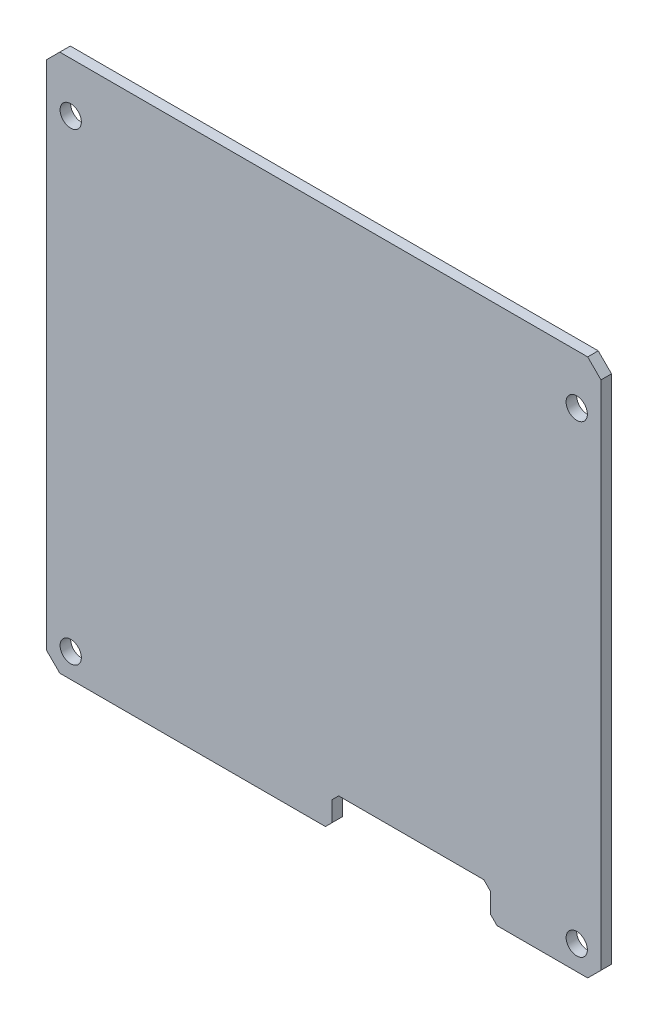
ISO-10303-21;
HEADER;
FILE_DESCRIPTION(('STEP AP214'),'2;1');
FILE_NAME('part.step','',(''),(''),'','','');
FILE_SCHEMA(('AUTOMOTIVE_DESIGN { 1 0 10303 214 1 1 1 1 }'));
ENDSEC;
DATA;
#1=APPLICATION_CONTEXT('core data for automotive mechanical design processes');
#2=APPLICATION_PROTOCOL_DEFINITION('international standard','automotive_design',2000,#1);
#3=PRODUCT_CONTEXT('',#1,'mechanical');
#4=PRODUCT('Part','Part','',(#3));
#5=PRODUCT_RELATED_PRODUCT_CATEGORY('part','',(#4));
#6=PRODUCT_DEFINITION_FORMATION('','',#4);
#7=PRODUCT_DEFINITION_CONTEXT('part definition',#1,'design');
#8=PRODUCT_DEFINITION('design','',#6,#7);
#9=PRODUCT_DEFINITION_SHAPE('','',#8);
#10=(LENGTH_UNIT() NAMED_UNIT(*) SI_UNIT(.MILLI.,.METRE.));
#11=(NAMED_UNIT(*) PLANE_ANGLE_UNIT() SI_UNIT($,.RADIAN.));
#12=(NAMED_UNIT(*) SI_UNIT($,.STERADIAN.) SOLID_ANGLE_UNIT());
#13=UNCERTAINTY_MEASURE_WITH_UNIT(LENGTH_MEASURE(1.E-05),#10,'distance_accuracy_value','');
#14=(GEOMETRIC_REPRESENTATION_CONTEXT(3) GLOBAL_UNCERTAINTY_ASSIGNED_CONTEXT((#13)) GLOBAL_UNIT_ASSIGNED_CONTEXT((#10,
#11,#12)) REPRESENTATION_CONTEXT('',''));
#15=CARTESIAN_POINT('',(0.,0.,0.));
#16=DIRECTION('',(0.,0.,1.));
#17=DIRECTION('',(1.,0.,0.));
#18=AXIS2_PLACEMENT_3D('',#15,#16,#17);
#19=CARTESIAN_POINT('',(41.75,-40.5,-0.0125000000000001));
#20=DIRECTION('',(0.,-1.,0.));
#21=DIRECTION('',(0.,0.,-1.));
#22=AXIS2_PLACEMENT_3D('',#19,#20,#21);
#23=PLANE('',#22);
#24=DIRECTION('',(-1.,0.,0.));
#25=VECTOR('',#24,1.);
#26=CARTESIAN_POINT('',(41.75,-40.5,-1.6));
#27=LINE('',#26,#25);
#28=CARTESIAN_POINT('',(0.249999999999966,-40.5,-1.6));
#29=VERTEX_POINT('',#28);
#30=CARTESIAN_POINT('',(-39.75,-40.5,-1.6));
#31=VERTEX_POINT('',#30);
#32=EDGE_CURVE('E303',#29,#31,#27,.T.);
#33=ORIENTED_EDGE('',*,*,#32,.F.);
#34=DIRECTION('',(0.,0.,1.));
#35=VECTOR('',#34,1.);
#36=CARTESIAN_POINT('',(0.249999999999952,-40.5,-0.0125000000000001));
#37=LINE('',#36,#35);
#38=CARTESIAN_POINT('',(0.249999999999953,-40.5,-0.0125000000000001));
#39=VERTEX_POINT('',#38);
#40=EDGE_CURVE('E218',#29,#39,#37,.T.);
#41=ORIENTED_EDGE('',*,*,#40,.T.);
#42=DIRECTION('',(-1.,0.,0.));
#43=VECTOR('',#42,1.);
#44=CARTESIAN_POINT('',(41.75,-40.5,-0.0125000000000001));
#45=LINE('',#44,#43);
#46=CARTESIAN_POINT('',(-39.75,-40.5,-0.0125000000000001));
#47=VERTEX_POINT('',#46);
#48=EDGE_CURVE('E178',#39,#47,#45,.T.);
#49=ORIENTED_EDGE('',*,*,#48,.T.);
#50=DIRECTION('',(0.,0.,-1.));
#51=VECTOR('',#50,1.);
#52=CARTESIAN_POINT('',(-39.75,-40.5,-0.0125000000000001));
#53=LINE('',#52,#51);
#54=EDGE_CURVE('E206',#47,#31,#53,.T.);
#55=ORIENTED_EDGE('',*,*,#54,.T.);
#56=EDGE_LOOP('',(#33,#41,#49,#55));
#57=FACE_BOUND('',#56,.T.);
#58=ADVANCED_FACE('F32',(#57),#23,.T.);
#59=CARTESIAN_POINT('',(-41.75,-40.5,-0.0125000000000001));
#60=DIRECTION('',(-1.,0.,0.));
#61=DIRECTION('',(0.,0.,1.));
#62=AXIS2_PLACEMENT_3D('',#59,#60,#61);
#63=PLANE('',#62);
#64=DIRECTION('',(0.,1.,0.));
#65=VECTOR('',#64,1.);
#66=CARTESIAN_POINT('',(-41.75,-40.5,-0.0125000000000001));
#67=LINE('',#66,#65);
#68=CARTESIAN_POINT('',(-41.75,-38.5,-0.0125000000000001));
#69=VERTEX_POINT('',#68);
#70=CARTESIAN_POINT('',(-41.75,38.5,-0.0125000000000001));
#71=VERTEX_POINT('',#70);
#72=EDGE_CURVE('E294',#69,#71,#67,.T.);
#73=ORIENTED_EDGE('',*,*,#72,.T.);
#74=DIRECTION('',(0.,0.,-1.));
#75=VECTOR('',#74,1.);
#76=CARTESIAN_POINT('',(-41.75,38.5,-0.0125000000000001));
#77=LINE('',#76,#75);
#78=CARTESIAN_POINT('',(-41.75,38.5,-1.6));
#79=VERTEX_POINT('',#78);
#80=EDGE_CURVE('E202',#71,#79,#77,.T.);
#81=ORIENTED_EDGE('',*,*,#80,.T.);
#82=DIRECTION('',(0.,1.,0.));
#83=VECTOR('',#82,1.);
#84=CARTESIAN_POINT('',(-41.75,-40.5,-1.6));
#85=LINE('',#84,#83);
#86=CARTESIAN_POINT('',(-41.75,-38.5,-1.6));
#87=VERTEX_POINT('',#86);
#88=EDGE_CURVE('E153',#87,#79,#85,.T.);
#89=ORIENTED_EDGE('',*,*,#88,.F.);
#90=DIRECTION('',(0.,0.,1.));
#91=VECTOR('',#90,1.);
#92=CARTESIAN_POINT('',(-41.75,-38.5,-0.0125000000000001));
#93=LINE('',#92,#91);
#94=EDGE_CURVE('E200',#87,#69,#93,.T.);
#95=ORIENTED_EDGE('',*,*,#94,.T.);
#96=EDGE_LOOP('',(#73,#81,#89,#95));
#97=FACE_BOUND('',#96,.T.);
#98=ADVANCED_FACE('F327',(#97),#63,.T.);
#99=CARTESIAN_POINT('',(39.75,-40.5,-0.0125000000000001));
#100=VERTEX_POINT('',#99);
#101=CARTESIAN_POINT('',(26.1,-40.5,-0.0125000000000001));
#102=VERTEX_POINT('',#101);
#103=EDGE_CURVE('E174',#100,#102,#45,.T.);
#104=ORIENTED_EDGE('',*,*,#103,.T.);
#105=DIRECTION('',(0.,0.,-1.));
#106=VECTOR('',#105,1.);
#107=CARTESIAN_POINT('',(26.1,-40.5,-1.6));
#108=LINE('',#107,#106);
#109=CARTESIAN_POINT('',(26.1,-40.5,-1.6));
#110=VERTEX_POINT('',#109);
#111=EDGE_CURVE('E232',#102,#110,#108,.T.);
#112=ORIENTED_EDGE('',*,*,#111,.T.);
#113=CARTESIAN_POINT('',(39.75,-40.5,-1.6));
#114=VERTEX_POINT('',#113);
#115=EDGE_CURVE('E181',#114,#110,#27,.T.);
#116=ORIENTED_EDGE('',*,*,#115,.F.);
#117=DIRECTION('',(0.,0.,1.));
#118=VECTOR('',#117,1.);
#119=CARTESIAN_POINT('',(39.75,-40.5,-0.0125000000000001));
#120=LINE('',#119,#118);
#121=EDGE_CURVE('E204',#114,#100,#120,.T.);
#122=ORIENTED_EDGE('',*,*,#121,.T.);
#123=EDGE_LOOP('',(#104,#112,#116,#122));
#124=FACE_BOUND('',#123,.T.);
#125=ADVANCED_FACE('F311',(#124),#23,.T.);
#126=CARTESIAN_POINT('',(41.75,-40.5,-0.0125000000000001));
#127=DIRECTION('',(1.,0.,0.));
#128=DIRECTION('',(0.,0.,-1.));
#129=AXIS2_PLACEMENT_3D('',#126,#127,#128);
#130=PLANE('',#129);
#131=DIRECTION('',(0.,-1.,0.));
#132=VECTOR('',#131,1.);
#133=CARTESIAN_POINT('',(41.75,-40.5,-1.6));
#134=LINE('',#133,#132);
#135=CARTESIAN_POINT('',(41.75,38.5,-1.6));
#136=VERTEX_POINT('',#135);
#137=CARTESIAN_POINT('',(41.75,-38.5,-1.6));
#138=VERTEX_POINT('',#137);
#139=EDGE_CURVE('E169',#136,#138,#134,.T.);
#140=ORIENTED_EDGE('',*,*,#139,.F.);
#141=DIRECTION('',(0.,0.,1.));
#142=VECTOR('',#141,1.);
#143=CARTESIAN_POINT('',(41.75,38.5,-0.0125000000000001));
#144=LINE('',#143,#142);
#145=CARTESIAN_POINT('',(41.75,38.5,-0.0125000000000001));
#146=VERTEX_POINT('',#145);
#147=EDGE_CURVE('E190',#136,#146,#144,.T.);
#148=ORIENTED_EDGE('',*,*,#147,.T.);
#149=DIRECTION('',(0.,-1.,0.));
#150=VECTOR('',#149,1.);
#151=CARTESIAN_POINT('',(41.75,-40.5,-0.0125000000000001));
#152=LINE('',#151,#150);
#153=CARTESIAN_POINT('',(41.75,-38.5,-0.0125000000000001));
#154=VERTEX_POINT('',#153);
#155=EDGE_CURVE('E299',#146,#154,#152,.T.);
#156=ORIENTED_EDGE('',*,*,#155,.T.);
#157=DIRECTION('',(0.,0.,-1.));
#158=VECTOR('',#157,1.);
#159=CARTESIAN_POINT('',(41.75,-38.5,-0.0125000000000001));
#160=LINE('',#159,#158);
#161=EDGE_CURVE('E187',#154,#138,#160,.T.);
#162=ORIENTED_EDGE('',*,*,#161,.T.);
#163=EDGE_LOOP('',(#140,#148,#156,#162));
#164=FACE_BOUND('',#163,.T.);
#165=ADVANCED_FACE('F320',(#164),#130,.T.);
#166=CARTESIAN_POINT('',(41.75,40.5,-0.0125000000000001));
#167=DIRECTION('',(0.,1.,0.));
#168=DIRECTION('',(0.,0.,1.));
#169=AXIS2_PLACEMENT_3D('',#166,#167,#168);
#170=PLANE('',#169);
#171=DIRECTION('',(1.,0.,0.));
#172=VECTOR('',#171,1.);
#173=CARTESIAN_POINT('',(41.75,40.5,-0.0125000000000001));
#174=LINE('',#173,#172);
#175=CARTESIAN_POINT('',(-39.75,40.5,-0.0125000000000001));
#176=VERTEX_POINT('',#175);
#177=CARTESIAN_POINT('',(39.75,40.5,-0.0125000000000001));
#178=VERTEX_POINT('',#177);
#179=EDGE_CURVE('E297',#176,#178,#174,.T.);
#180=ORIENTED_EDGE('',*,*,#179,.T.);
#181=DIRECTION('',(0.,0.,-1.));
#182=VECTOR('',#181,1.);
#183=CARTESIAN_POINT('',(39.75,40.5,-0.0125000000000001));
#184=LINE('',#183,#182);
#185=CARTESIAN_POINT('',(39.75,40.5,-1.6));
#186=VERTEX_POINT('',#185);
#187=EDGE_CURVE('E168',#178,#186,#184,.T.);
#188=ORIENTED_EDGE('',*,*,#187,.T.);
#189=DIRECTION('',(1.,0.,0.));
#190=VECTOR('',#189,1.);
#191=CARTESIAN_POINT('',(41.75,40.5,-1.6));
#192=LINE('',#191,#190);
#193=CARTESIAN_POINT('',(-39.75,40.5,-1.6));
#194=VERTEX_POINT('',#193);
#195=EDGE_CURVE('E151',#194,#186,#192,.T.);
#196=ORIENTED_EDGE('',*,*,#195,.F.);
#197=DIRECTION('',(0.,0.,1.));
#198=VECTOR('',#197,1.);
#199=CARTESIAN_POINT('',(-39.75,40.5,-0.0125000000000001));
#200=LINE('',#199,#198);
#201=EDGE_CURVE('E165',#194,#176,#200,.T.);
#202=ORIENTED_EDGE('',*,*,#201,.T.);
#203=EDGE_LOOP('',(#180,#188,#196,#202));
#204=FACE_BOUND('',#203,.T.);
#205=ADVANCED_FACE('F164',(#204),#170,.T.);
#206=CARTESIAN_POINT('',(0.,0.,-0.0125000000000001));
#207=DIRECTION('',(0.,0.,1.));
#208=DIRECTION('',(1.,0.,0.));
#209=AXIS2_PLACEMENT_3D('',#206,#207,#208);
#210=PLANE('',#209);
#211=ORIENTED_EDGE('',*,*,#48,.F.);
#212=DIRECTION('',(0.707106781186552,0.707106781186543,0.));
#213=VECTOR('',#212,1.);
#214=CARTESIAN_POINT('',(20.375,-20.3750000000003,-0.0125000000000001));
#215=LINE('',#214,#213);
#216=CARTESIAN_POINT('',(1.24999999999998,-39.5,-0.0125000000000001));
#217=VERTEX_POINT('',#216);
#218=EDGE_CURVE('E221',#39,#217,#215,.T.);
#219=ORIENTED_EDGE('',*,*,#218,.T.);
#220=DIRECTION('',(0.,1.,0.));
#221=VECTOR('',#220,1.);
#222=CARTESIAN_POINT('',(1.24999999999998,-35.5,-0.0125000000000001));
#223=LINE('',#222,#221);
#224=CARTESIAN_POINT('',(1.24999999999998,-36.5,-0.0125000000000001));
#225=VERTEX_POINT('',#224);
#226=EDGE_CURVE('E261',#217,#225,#223,.T.);
#227=ORIENTED_EDGE('',*,*,#226,.T.);
#228=DIRECTION('',(-0.707106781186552,-0.707106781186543,0.));
#229=VECTOR('',#228,1.);
#230=CARTESIAN_POINT('',(2.24999999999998,-35.5,-0.0125000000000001));
#231=LINE('',#230,#229);
#232=CARTESIAN_POINT('',(2.24999999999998,-35.5,-0.0125000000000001));
#233=VERTEX_POINT('',#232);
#234=EDGE_CURVE('E237',#225,#233,#231,.F.);
#235=ORIENTED_EDGE('',*,*,#234,.T.);
#236=DIRECTION('',(1.,0.,0.));
#237=VECTOR('',#236,1.);
#238=CARTESIAN_POINT('',(1.24999999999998,-35.5,-0.0125000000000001));
#239=LINE('',#238,#237);
#240=CARTESIAN_POINT('',(24.1,-35.5,-0.0125000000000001));
#241=VERTEX_POINT('',#240);
#242=EDGE_CURVE('E259',#233,#241,#239,.T.);
#243=ORIENTED_EDGE('',*,*,#242,.T.);
#244=DIRECTION('',(-0.707106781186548,0.707106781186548,0.));
#245=VECTOR('',#244,1.);
#246=CARTESIAN_POINT('',(25.1,-36.5,-0.0125000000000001));
#247=LINE('',#246,#245);
#248=CARTESIAN_POINT('',(25.1,-36.5,-0.0125000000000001));
#249=VERTEX_POINT('',#248);
#250=EDGE_CURVE('E11',#241,#249,#247,.F.);
#251=ORIENTED_EDGE('',*,*,#250,.T.);
#252=DIRECTION('',(0.,-1.,0.));
#253=VECTOR('',#252,1.);
#254=CARTESIAN_POINT('',(25.1,-35.5,-0.0125000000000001));
#255=LINE('',#254,#253);
#256=CARTESIAN_POINT('',(25.1,-39.5,-0.0125000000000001));
#257=VERTEX_POINT('',#256);
#258=EDGE_CURVE('E258',#249,#257,#255,.T.);
#259=ORIENTED_EDGE('',*,*,#258,.T.);
#260=DIRECTION('',(0.707106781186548,-0.707106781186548,0.));
#261=VECTOR('',#260,1.);
#262=CARTESIAN_POINT('',(-7.20000000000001,-7.20000000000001,-0.0125000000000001));
#263=LINE('',#262,#261);
#264=EDGE_CURVE('E47',#257,#102,#263,.T.);
#265=ORIENTED_EDGE('',*,*,#264,.T.);
#266=ORIENTED_EDGE('',*,*,#103,.F.);
#267=DIRECTION('',(-0.707106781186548,-0.707106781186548,0.));
#268=VECTOR('',#267,1.);
#269=CARTESIAN_POINT('',(40.125,-40.125,-0.0125000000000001));
#270=LINE('',#269,#268);
#271=EDGE_CURVE('E192',#100,#154,#270,.F.);
#272=ORIENTED_EDGE('',*,*,#271,.T.);
#273=ORIENTED_EDGE('',*,*,#155,.F.);
#274=DIRECTION('',(0.707106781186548,-0.707106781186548,0.));
#275=VECTOR('',#274,1.);
#276=CARTESIAN_POINT('',(40.125,40.125,-0.0125000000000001));
#277=LINE('',#276,#275);
#278=EDGE_CURVE('E198',#146,#178,#277,.F.);
#279=ORIENTED_EDGE('',*,*,#278,.T.);
#280=ORIENTED_EDGE('',*,*,#179,.F.);
#281=DIRECTION('',(0.707106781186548,0.707106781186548,0.));
#282=VECTOR('',#281,1.);
#283=CARTESIAN_POINT('',(-40.125,40.125,-0.0125000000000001));
#284=LINE('',#283,#282);
#285=EDGE_CURVE('E173',#176,#71,#284,.F.);
#286=ORIENTED_EDGE('',*,*,#285,.T.);
#287=ORIENTED_EDGE('',*,*,#72,.F.);
#288=DIRECTION('',(-0.707106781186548,0.707106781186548,0.));
#289=VECTOR('',#288,1.);
#290=CARTESIAN_POINT('',(-40.125,-40.125,-0.0125000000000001));
#291=LINE('',#290,#289);
#292=EDGE_CURVE('E194',#69,#47,#291,.F.);
#293=ORIENTED_EDGE('',*,*,#292,.T.);
#294=EDGE_LOOP('',(#211,#219,#227,#235,#243,#251,#259,#265,#266,#272,#273,#279,#280,#286,#287,#293));
#295=FACE_BOUND('',#294,.T.);
#296=CARTESIAN_POINT('',(-38.1,-36.85,-0.0125000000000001));
#297=DIRECTION('',(0.,0.,1.));
#298=DIRECTION('',(1.,0.,0.));
#299=AXIS2_PLACEMENT_3D('',#296,#297,#298);
#300=CIRCLE('',#299,1.6);
#301=CARTESIAN_POINT('',(-36.5,-36.85,-0.0125000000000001));
#302=VERTEX_POINT('',#301);
#303=EDGE_CURVE('E270',#302,#302,#300,.F.);
#304=ORIENTED_EDGE('',*,*,#303,.T.);
#305=EDGE_LOOP('',(#304));
#306=FACE_BOUND('',#305,.T.);
#307=CARTESIAN_POINT('',(38.1,-36.85,-0.0125000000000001));
#308=DIRECTION('',(0.,0.,1.));
#309=DIRECTION('',(1.,0.,0.));
#310=AXIS2_PLACEMENT_3D('',#307,#308,#309);
#311=CIRCLE('',#310,1.6);
#312=CARTESIAN_POINT('',(39.7,-36.85,-0.0125000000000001));
#313=VERTEX_POINT('',#312);
#314=EDGE_CURVE('E274',#313,#313,#311,.F.);
#315=ORIENTED_EDGE('',*,*,#314,.T.);
#316=EDGE_LOOP('',(#315));
#317=FACE_BOUND('',#316,.T.);
#318=CARTESIAN_POINT('',(38.1,33.,-0.0125000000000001));
#319=DIRECTION('',(0.,0.,1.));
#320=DIRECTION('',(1.,0.,0.));
#321=AXIS2_PLACEMENT_3D('',#318,#319,#320);
#322=CIRCLE('',#321,1.6);
#323=CARTESIAN_POINT('',(39.7,33.,-0.0125000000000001));
#324=VERTEX_POINT('',#323);
#325=EDGE_CURVE('E280',#324,#324,#322,.F.);
#326=ORIENTED_EDGE('',*,*,#325,.T.);
#327=EDGE_LOOP('',(#326));
#328=FACE_BOUND('',#327,.T.);
#329=CARTESIAN_POINT('',(-38.1,33.,-0.0125000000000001));
#330=DIRECTION('',(0.,0.,1.));
#331=DIRECTION('',(1.,0.,0.));
#332=AXIS2_PLACEMENT_3D('',#329,#330,#331);
#333=CIRCLE('',#332,1.6);
#334=CARTESIAN_POINT('',(-36.5,33.,-0.0125000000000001));
#335=VERTEX_POINT('',#334);
#336=EDGE_CURVE('E286',#335,#335,#333,.F.);
#337=ORIENTED_EDGE('',*,*,#336,.T.);
#338=EDGE_LOOP('',(#337));
#339=FACE_BOUND('',#338,.T.);
#340=ADVANCED_FACE('F256',(#295,#306,#317,#328,#339),#210,.T.);
#341=CARTESIAN_POINT('',(0.,0.,-1.6));
#342=DIRECTION('',(0.,0.,1.));
#343=DIRECTION('',(1.,0.,0.));
#344=AXIS2_PLACEMENT_3D('',#341,#342,#343);
#345=PLANE('',#344);
#346=CARTESIAN_POINT('',(-38.1,-36.85,-1.6));
#347=DIRECTION('',(0.,0.,-1.));
#348=DIRECTION('',(-1.,0.,0.));
#349=AXIS2_PLACEMENT_3D('',#346,#347,#348);
#350=CIRCLE('',#349,1.6);
#351=CARTESIAN_POINT('',(-39.7,-36.85,-1.6));
#352=VERTEX_POINT('',#351);
#353=EDGE_CURVE('E271',#352,#352,#350,.T.);
#354=ORIENTED_EDGE('',*,*,#353,.F.);
#355=EDGE_LOOP('',(#354));
#356=FACE_BOUND('',#355,.T.);
#357=CARTESIAN_POINT('',(38.1,-36.85,-1.6));
#358=DIRECTION('',(0.,0.,-1.));
#359=DIRECTION('',(-1.,0.,0.));
#360=AXIS2_PLACEMENT_3D('',#357,#358,#359);
#361=CIRCLE('',#360,1.6);
#362=CARTESIAN_POINT('',(36.5,-36.85,-1.6));
#363=VERTEX_POINT('',#362);
#364=EDGE_CURVE('E277',#363,#363,#361,.T.);
#365=ORIENTED_EDGE('',*,*,#364,.F.);
#366=EDGE_LOOP('',(#365));
#367=FACE_BOUND('',#366,.T.);
#368=CARTESIAN_POINT('',(38.1,33.,-1.6));
#369=DIRECTION('',(0.,0.,-1.));
#370=DIRECTION('',(-1.,0.,0.));
#371=AXIS2_PLACEMENT_3D('',#368,#369,#370);
#372=CIRCLE('',#371,1.6);
#373=CARTESIAN_POINT('',(36.5,33.,-1.6));
#374=VERTEX_POINT('',#373);
#375=EDGE_CURVE('E283',#374,#374,#372,.T.);
#376=ORIENTED_EDGE('',*,*,#375,.F.);
#377=EDGE_LOOP('',(#376));
#378=FACE_BOUND('',#377,.T.);
#379=CARTESIAN_POINT('',(-38.1,33.,-1.6));
#380=DIRECTION('',(0.,0.,-1.));
#381=DIRECTION('',(-1.,0.,0.));
#382=AXIS2_PLACEMENT_3D('',#379,#380,#381);
#383=CIRCLE('',#382,1.6);
#384=CARTESIAN_POINT('',(-39.7,33.,-1.6));
#385=VERTEX_POINT('',#384);
#386=EDGE_CURVE('E289',#385,#385,#383,.T.);
#387=ORIENTED_EDGE('',*,*,#386,.F.);
#388=EDGE_LOOP('',(#387));
#389=FACE_BOUND('',#388,.T.);
#390=DIRECTION('',(0.,1.,0.));
#391=VECTOR('',#390,1.);
#392=CARTESIAN_POINT('',(1.24999999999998,-35.5,-1.6));
#393=LINE('',#392,#391);
#394=CARTESIAN_POINT('',(1.24999999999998,-39.5,-1.6));
#395=VERTEX_POINT('',#394);
#396=CARTESIAN_POINT('',(1.24999999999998,-36.5,-1.6));
#397=VERTEX_POINT('',#396);
#398=EDGE_CURVE('E251',#395,#397,#393,.T.);
#399=ORIENTED_EDGE('',*,*,#398,.F.);
#400=DIRECTION('',(-0.707106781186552,-0.707106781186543,0.));
#401=VECTOR('',#400,1.);
#402=CARTESIAN_POINT('',(1.24999999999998,-39.5,-1.6));
#403=LINE('',#402,#401);
#404=EDGE_CURVE('E216',#395,#29,#403,.T.);
#405=ORIENTED_EDGE('',*,*,#404,.T.);
#406=ORIENTED_EDGE('',*,*,#32,.T.);
#407=DIRECTION('',(0.707106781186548,-0.707106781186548,0.));
#408=VECTOR('',#407,1.);
#409=CARTESIAN_POINT('',(-39.75,-40.5,-1.6));
#410=LINE('',#409,#408);
#411=EDGE_CURVE('E159',#31,#87,#410,.F.);
#412=ORIENTED_EDGE('',*,*,#411,.T.);
#413=ORIENTED_EDGE('',*,*,#88,.T.);
#414=DIRECTION('',(-0.707106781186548,-0.707106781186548,0.));
#415=VECTOR('',#414,1.);
#416=CARTESIAN_POINT('',(-41.75,38.5,-1.6));
#417=LINE('',#416,#415);
#418=EDGE_CURVE('E147',#79,#194,#417,.F.);
#419=ORIENTED_EDGE('',*,*,#418,.T.);
#420=ORIENTED_EDGE('',*,*,#195,.T.);
#421=DIRECTION('',(-0.707106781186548,0.707106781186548,0.));
#422=VECTOR('',#421,1.);
#423=CARTESIAN_POINT('',(39.75,40.5,-1.6));
#424=LINE('',#423,#422);
#425=EDGE_CURVE('E158',#186,#136,#424,.F.);
#426=ORIENTED_EDGE('',*,*,#425,.T.);
#427=ORIENTED_EDGE('',*,*,#139,.T.);
#428=DIRECTION('',(0.707106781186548,0.707106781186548,0.));
#429=VECTOR('',#428,1.);
#430=CARTESIAN_POINT('',(41.75,-38.5,-1.6));
#431=LINE('',#430,#429);
#432=EDGE_CURVE('E176',#138,#114,#431,.F.);
#433=ORIENTED_EDGE('',*,*,#432,.T.);
#434=ORIENTED_EDGE('',*,*,#115,.T.);
#435=DIRECTION('',(-0.707106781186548,0.707106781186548,0.));
#436=VECTOR('',#435,1.);
#437=CARTESIAN_POINT('',(26.1,-40.5,-1.6));
#438=LINE('',#437,#436);
#439=CARTESIAN_POINT('',(25.1,-39.5,-1.6));
#440=VERTEX_POINT('',#439);
#441=EDGE_CURVE('E214',#110,#440,#438,.T.);
#442=ORIENTED_EDGE('',*,*,#441,.T.);
#443=DIRECTION('',(0.,-1.,0.));
#444=VECTOR('',#443,1.);
#445=CARTESIAN_POINT('',(25.1,-35.5,-1.6));
#446=LINE('',#445,#444);
#447=CARTESIAN_POINT('',(25.1,-36.5,-1.6));
#448=VERTEX_POINT('',#447);
#449=EDGE_CURVE('E242',#448,#440,#446,.T.);
#450=ORIENTED_EDGE('',*,*,#449,.F.);
#451=DIRECTION('',(0.707106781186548,-0.707106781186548,0.));
#452=VECTOR('',#451,1.);
#453=CARTESIAN_POINT('',(-5.70000000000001,-5.70000000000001,-1.6));
#454=LINE('',#453,#452);
#455=CARTESIAN_POINT('',(24.1,-35.5,-1.6));
#456=VERTEX_POINT('',#455);
#457=EDGE_CURVE('E40',#448,#456,#454,.F.);
#458=ORIENTED_EDGE('',*,*,#457,.T.);
#459=DIRECTION('',(1.,0.,0.));
#460=VECTOR('',#459,1.);
#461=CARTESIAN_POINT('',(1.24999999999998,-35.5,-1.6));
#462=LINE('',#461,#460);
#463=CARTESIAN_POINT('',(2.24999999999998,-35.5,-1.6));
#464=VERTEX_POINT('',#463);
#465=EDGE_CURVE('E241',#464,#456,#462,.T.);
#466=ORIENTED_EDGE('',*,*,#465,.F.);
#467=DIRECTION('',(0.707106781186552,0.707106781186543,0.));
#468=VECTOR('',#467,1.);
#469=CARTESIAN_POINT('',(18.875,-18.8750000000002,-1.6));
#470=LINE('',#469,#468);
#471=EDGE_CURVE('E235',#464,#397,#470,.F.);
#472=ORIENTED_EDGE('',*,*,#471,.T.);
#473=EDGE_LOOP('',(#399,#405,#406,#412,#413,#419,#420,#426,#427,#433,#434,#442,#450,#458,#466,#472));
#474=FACE_BOUND('',#473,.T.);
#475=ADVANCED_FACE('F150',(#356,#367,#378,#389,#474),#345,.F.);
#476=CARTESIAN_POINT('',(-38.1,33.,-0.0115000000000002));
#477=DIRECTION('',(0.,0.,-1.));
#478=DIRECTION('',(-1.,0.,0.));
#479=AXIS2_PLACEMENT_3D('',#476,#477,#478);
#480=CYLINDRICAL_SURFACE('',#479,1.6);
#481=ORIENTED_EDGE('',*,*,#336,.F.);
#482=EDGE_LOOP('',(#481));
#483=FACE_BOUND('',#482,.T.);
#484=ORIENTED_EDGE('',*,*,#386,.T.);
#485=EDGE_LOOP('',(#484));
#486=FACE_BOUND('',#485,.T.);
#487=ADVANCED_FACE('F397',(#483,#486),#480,.F.);
#488=CARTESIAN_POINT('',(38.1,33.,-0.0115000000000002));
#489=DIRECTION('',(0.,0.,-1.));
#490=DIRECTION('',(-1.,0.,0.));
#491=AXIS2_PLACEMENT_3D('',#488,#489,#490);
#492=CYLINDRICAL_SURFACE('',#491,1.6);
#493=ORIENTED_EDGE('',*,*,#325,.F.);
#494=EDGE_LOOP('',(#493));
#495=FACE_BOUND('',#494,.T.);
#496=ORIENTED_EDGE('',*,*,#375,.T.);
#497=EDGE_LOOP('',(#496));
#498=FACE_BOUND('',#497,.T.);
#499=ADVANCED_FACE('F393',(#495,#498),#492,.F.);
#500=CARTESIAN_POINT('',(38.1,-36.85,-0.0115000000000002));
#501=DIRECTION('',(0.,0.,-1.));
#502=DIRECTION('',(-1.,0.,0.));
#503=AXIS2_PLACEMENT_3D('',#500,#501,#502);
#504=CYLINDRICAL_SURFACE('',#503,1.6);
#505=ORIENTED_EDGE('',*,*,#314,.F.);
#506=EDGE_LOOP('',(#505));
#507=FACE_BOUND('',#506,.T.);
#508=ORIENTED_EDGE('',*,*,#364,.T.);
#509=EDGE_LOOP('',(#508));
#510=FACE_BOUND('',#509,.T.);
#511=ADVANCED_FACE('F389',(#507,#510),#504,.F.);
#512=CARTESIAN_POINT('',(-38.1,-36.85,-0.0115000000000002));
#513=DIRECTION('',(0.,0.,-1.));
#514=DIRECTION('',(-1.,0.,0.));
#515=AXIS2_PLACEMENT_3D('',#512,#513,#514);
#516=CYLINDRICAL_SURFACE('',#515,1.6);
#517=ORIENTED_EDGE('',*,*,#303,.F.);
#518=EDGE_LOOP('',(#517));
#519=FACE_BOUND('',#518,.T.);
#520=ORIENTED_EDGE('',*,*,#353,.T.);
#521=EDGE_LOOP('',(#520));
#522=FACE_BOUND('',#521,.T.);
#523=ADVANCED_FACE('F371',(#519,#522),#516,.F.);
#524=CARTESIAN_POINT('',(39.75,40.5,-0.0125000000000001));
#525=DIRECTION('',(-0.707106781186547,-0.707106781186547,0.));
#526=DIRECTION('',(0.,0.,-1.));
#527=AXIS2_PLACEMENT_3D('',#524,#525,#526);
#528=PLANE('',#527);
#529=ORIENTED_EDGE('',*,*,#278,.F.);
#530=ORIENTED_EDGE('',*,*,#147,.F.);
#531=ORIENTED_EDGE('',*,*,#425,.F.);
#532=ORIENTED_EDGE('',*,*,#187,.F.);
#533=EDGE_LOOP('',(#529,#530,#531,#532));
#534=FACE_BOUND('',#533,.T.);
#535=ADVANCED_FACE('F323',(#534),#528,.F.);
#536=CARTESIAN_POINT('',(-41.75,38.5,-0.0125000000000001));
#537=DIRECTION('',(0.707106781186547,-0.707106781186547,0.));
#538=DIRECTION('',(0.,0.,-1.));
#539=AXIS2_PLACEMENT_3D('',#536,#537,#538);
#540=PLANE('',#539);
#541=ORIENTED_EDGE('',*,*,#285,.F.);
#542=ORIENTED_EDGE('',*,*,#201,.F.);
#543=ORIENTED_EDGE('',*,*,#418,.F.);
#544=ORIENTED_EDGE('',*,*,#80,.F.);
#545=EDGE_LOOP('',(#541,#542,#543,#544));
#546=FACE_BOUND('',#545,.T.);
#547=ADVANCED_FACE('F172',(#546),#540,.F.);
#548=CARTESIAN_POINT('',(-39.75,-40.5,-0.0125000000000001));
#549=DIRECTION('',(0.707106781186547,0.707106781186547,0.));
#550=DIRECTION('',(0.,0.,-1.));
#551=AXIS2_PLACEMENT_3D('',#548,#549,#550);
#552=PLANE('',#551);
#553=ORIENTED_EDGE('',*,*,#292,.F.);
#554=ORIENTED_EDGE('',*,*,#94,.F.);
#555=ORIENTED_EDGE('',*,*,#411,.F.);
#556=ORIENTED_EDGE('',*,*,#54,.F.);
#557=EDGE_LOOP('',(#553,#554,#555,#556));
#558=FACE_BOUND('',#557,.T.);
#559=ADVANCED_FACE('F330',(#558),#552,.F.);
#560=CARTESIAN_POINT('',(41.75,-38.5,-0.0125000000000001));
#561=DIRECTION('',(-0.707106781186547,0.707106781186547,0.));
#562=DIRECTION('',(0.,0.,-1.));
#563=AXIS2_PLACEMENT_3D('',#560,#561,#562);
#564=PLANE('',#563);
#565=ORIENTED_EDGE('',*,*,#271,.F.);
#566=ORIENTED_EDGE('',*,*,#121,.F.);
#567=ORIENTED_EDGE('',*,*,#432,.F.);
#568=ORIENTED_EDGE('',*,*,#161,.F.);
#569=EDGE_LOOP('',(#565,#566,#567,#568));
#570=FACE_BOUND('',#569,.T.);
#571=ADVANCED_FACE('F315',(#570),#564,.F.);
#572=CARTESIAN_POINT('',(1.24999999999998,-35.5,-0.0115000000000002));
#573=DIRECTION('',(-1.,0.,0.));
#574=DIRECTION('',(0.,-1.,0.));
#575=AXIS2_PLACEMENT_3D('',#572,#573,#574);
#576=PLANE('',#575);
#577=ORIENTED_EDGE('',*,*,#226,.F.);
#578=DIRECTION('',(0.,0.,-1.));
#579=VECTOR('',#578,1.);
#580=CARTESIAN_POINT('',(1.24999999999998,-39.5,-1.6));
#581=LINE('',#580,#579);
#582=EDGE_CURVE('E211',#217,#395,#581,.T.);
#583=ORIENTED_EDGE('',*,*,#582,.T.);
#584=ORIENTED_EDGE('',*,*,#398,.T.);
#585=DIRECTION('',(0.,0.,1.));
#586=VECTOR('',#585,1.);
#587=CARTESIAN_POINT('',(1.24999999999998,-36.5,-0.0125000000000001));
#588=LINE('',#587,#586);
#589=EDGE_CURVE('E209',#397,#225,#588,.T.);
#590=ORIENTED_EDGE('',*,*,#589,.T.);
#591=EDGE_LOOP('',(#577,#583,#584,#590));
#592=FACE_BOUND('',#591,.T.);
#593=ADVANCED_FACE('F340',(#592),#576,.F.);
#594=CARTESIAN_POINT('',(25.1,-35.5,-0.0115000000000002));
#595=DIRECTION('',(1.,0.,0.));
#596=DIRECTION('',(0.,1.,0.));
#597=AXIS2_PLACEMENT_3D('',#594,#595,#596);
#598=PLANE('',#597);
#599=ORIENTED_EDGE('',*,*,#258,.F.);
#600=DIRECTION('',(0.,0.,-1.));
#601=VECTOR('',#600,1.);
#602=CARTESIAN_POINT('',(25.1,-36.5,-1.6));
#603=LINE('',#602,#601);
#604=EDGE_CURVE('E229',#249,#448,#603,.T.);
#605=ORIENTED_EDGE('',*,*,#604,.T.);
#606=ORIENTED_EDGE('',*,*,#449,.T.);
#607=DIRECTION('',(0.,0.,1.));
#608=VECTOR('',#607,1.);
#609=CARTESIAN_POINT('',(25.1,-39.5,-0.0125000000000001));
#610=LINE('',#609,#608);
#611=EDGE_CURVE('E55',#440,#257,#610,.T.);
#612=ORIENTED_EDGE('',*,*,#611,.T.);
#613=EDGE_LOOP('',(#599,#605,#606,#612));
#614=FACE_BOUND('',#613,.T.);
#615=ADVANCED_FACE('F260',(#614),#598,.F.);
#616=CARTESIAN_POINT('',(1.24999999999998,-35.5,-0.0115000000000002));
#617=DIRECTION('',(0.,1.,0.));
#618=DIRECTION('',(0.,0.,1.));
#619=AXIS2_PLACEMENT_3D('',#616,#617,#618);
#620=PLANE('',#619);
#621=ORIENTED_EDGE('',*,*,#242,.F.);
#622=DIRECTION('',(0.,0.,-1.));
#623=VECTOR('',#622,1.);
#624=CARTESIAN_POINT('',(2.24999999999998,-35.5,-1.6));
#625=LINE('',#624,#623);
#626=EDGE_CURVE('E225',#233,#464,#625,.T.);
#627=ORIENTED_EDGE('',*,*,#626,.T.);
#628=ORIENTED_EDGE('',*,*,#465,.T.);
#629=DIRECTION('',(0.,0.,1.));
#630=VECTOR('',#629,1.);
#631=CARTESIAN_POINT('',(24.1,-35.5,-0.0125000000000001));
#632=LINE('',#631,#630);
#633=EDGE_CURVE('E223',#456,#241,#632,.T.);
#634=ORIENTED_EDGE('',*,*,#633,.T.);
#635=EDGE_LOOP('',(#621,#627,#628,#634));
#636=FACE_BOUND('',#635,.T.);
#637=ADVANCED_FACE('F248',(#636),#620,.F.);
#638=CARTESIAN_POINT('',(1.24999999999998,-39.5,-0.0115000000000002));
#639=DIRECTION('',(0.707106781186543,-0.707106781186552,0.));
#640=DIRECTION('',(0.,0.,1.));
#641=AXIS2_PLACEMENT_3D('',#638,#639,#640);
#642=PLANE('',#641);
#643=ORIENTED_EDGE('',*,*,#218,.F.);
#644=ORIENTED_EDGE('',*,*,#40,.F.);
#645=ORIENTED_EDGE('',*,*,#404,.F.);
#646=ORIENTED_EDGE('',*,*,#582,.F.);
#647=EDGE_LOOP('',(#643,#644,#645,#646));
#648=FACE_BOUND('',#647,.T.);
#649=ADVANCED_FACE('F338',(#648),#642,.T.);
#650=CARTESIAN_POINT('',(2.24999999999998,-35.5,-0.0115000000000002));
#651=DIRECTION('',(0.707106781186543,-0.707106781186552,0.));
#652=DIRECTION('',(0.,0.,1.));
#653=AXIS2_PLACEMENT_3D('',#650,#651,#652);
#654=PLANE('',#653);
#655=ORIENTED_EDGE('',*,*,#234,.F.);
#656=ORIENTED_EDGE('',*,*,#589,.F.);
#657=ORIENTED_EDGE('',*,*,#471,.F.);
#658=ORIENTED_EDGE('',*,*,#626,.F.);
#659=EDGE_LOOP('',(#655,#656,#657,#658));
#660=FACE_BOUND('',#659,.T.);
#661=ADVANCED_FACE('F344',(#660),#654,.T.);
#662=CARTESIAN_POINT('',(25.1,-36.5,-0.0115000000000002));
#663=DIRECTION('',(-0.707106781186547,-0.707106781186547,0.));
#664=DIRECTION('',(0.,0.,1.));
#665=AXIS2_PLACEMENT_3D('',#662,#663,#664);
#666=PLANE('',#665);
#667=ORIENTED_EDGE('',*,*,#250,.F.);
#668=ORIENTED_EDGE('',*,*,#633,.F.);
#669=ORIENTED_EDGE('',*,*,#457,.F.);
#670=ORIENTED_EDGE('',*,*,#604,.F.);
#671=EDGE_LOOP('',(#667,#668,#669,#670));
#672=FACE_BOUND('',#671,.T.);
#673=ADVANCED_FACE('F254',(#672),#666,.T.);
#674=CARTESIAN_POINT('',(26.1,-40.5,-0.0125000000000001));
#675=DIRECTION('',(-0.707106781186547,-0.707106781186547,0.));
#676=DIRECTION('',(0.,0.,1.));
#677=AXIS2_PLACEMENT_3D('',#674,#675,#676);
#678=PLANE('',#677);
#679=ORIENTED_EDGE('',*,*,#264,.F.);
#680=ORIENTED_EDGE('',*,*,#611,.F.);
#681=ORIENTED_EDGE('',*,*,#441,.F.);
#682=ORIENTED_EDGE('',*,*,#111,.F.);
#683=EDGE_LOOP('',(#679,#680,#681,#682));
#684=FACE_BOUND('',#683,.T.);
#685=ADVANCED_FACE('F34',(#684),#678,.T.);
#686=CLOSED_SHELL('',(#58,#98,#125,#165,#205,#340,#475,#487,#499,#511,#523,#535,#547,#559,#571,
#593,#615,#637,#649,#661,#673,#685));
#687=MANIFOLD_SOLID_BREP('B2',#686);
#688=ADVANCED_BREP_SHAPE_REPRESENTATION('',(#18,#687),#14);
#689=SHAPE_DEFINITION_REPRESENTATION(#9,#688);
ENDSEC;
END-ISO-10303-21;
